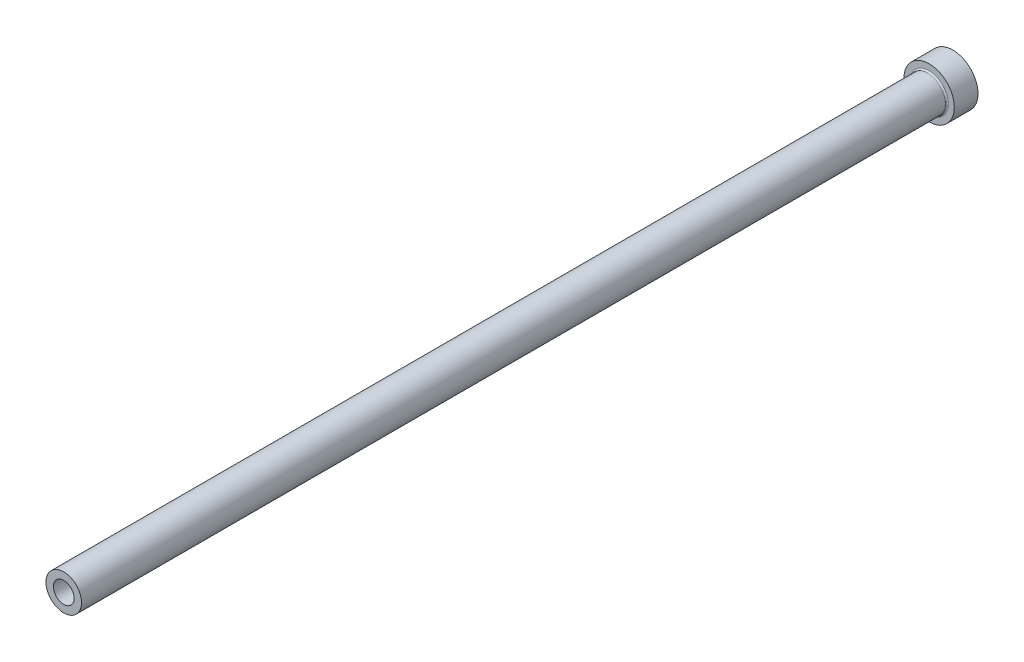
ISO-10303-21;
HEADER;
FILE_DESCRIPTION(('STEP AP214'),'2;1');
FILE_NAME('part.step','',(''),(''),'','','');
FILE_SCHEMA(('AUTOMOTIVE_DESIGN { 1 0 10303 214 1 1 1 1 }'));
ENDSEC;
DATA;
#1=APPLICATION_CONTEXT('core data for automotive mechanical design processes');
#2=APPLICATION_PROTOCOL_DEFINITION('international standard','automotive_design',2000,#1);
#3=PRODUCT_CONTEXT('',#1,'mechanical');
#4=PRODUCT('Part','Part','',(#3));
#5=PRODUCT_RELATED_PRODUCT_CATEGORY('part','',(#4));
#6=PRODUCT_DEFINITION_FORMATION('','',#4);
#7=PRODUCT_DEFINITION_CONTEXT('part definition',#1,'design');
#8=PRODUCT_DEFINITION('design','',#6,#7);
#9=PRODUCT_DEFINITION_SHAPE('','',#8);
#10=(LENGTH_UNIT() NAMED_UNIT(*) SI_UNIT(.MILLI.,.METRE.));
#11=(NAMED_UNIT(*) PLANE_ANGLE_UNIT() SI_UNIT($,.RADIAN.));
#12=(NAMED_UNIT(*) SI_UNIT($,.STERADIAN.) SOLID_ANGLE_UNIT());
#13=UNCERTAINTY_MEASURE_WITH_UNIT(LENGTH_MEASURE(1.E-05),#10,'distance_accuracy_value','');
#14=(GEOMETRIC_REPRESENTATION_CONTEXT(3) GLOBAL_UNCERTAINTY_ASSIGNED_CONTEXT((#13)) GLOBAL_UNIT_ASSIGNED_CONTEXT((#10,
#11,#12)) REPRESENTATION_CONTEXT('',''));
#15=CARTESIAN_POINT('',(0.,0.,0.));
#16=DIRECTION('',(0.,0.,1.));
#17=DIRECTION('',(1.,0.,0.));
#18=AXIS2_PLACEMENT_3D('',#15,#16,#17);
#19=CARTESIAN_POINT('',(0.,0.,300.));
#20=DIRECTION('',(0.,0.,-1.));
#21=DIRECTION('',(-1.,0.,0.));
#22=AXIS2_PLACEMENT_3D('',#19,#20,#21);
#23=PLANE('',#22);
#24=CARTESIAN_POINT('',(0.,0.,300.));
#25=DIRECTION('',(0.,0.,1.));
#26=DIRECTION('',(1.,0.,0.));
#27=AXIS2_PLACEMENT_3D('',#24,#25,#26);
#28=CIRCLE('',#27,3.49999999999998);
#29=CARTESIAN_POINT('',(3.49999999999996,0.,300.));
#30=VERTEX_POINT('',#29);
#31=EDGE_CURVE('E63',#30,#30,#28,.T.);
#32=ORIENTED_EDGE('',*,*,#31,.F.);
#33=EDGE_LOOP('',(#32));
#34=FACE_BOUND('',#33,.T.);
#35=CARTESIAN_POINT('',(0.,0.,300.));
#36=DIRECTION('',(0.,0.,1.));
#37=DIRECTION('',(1.,0.,0.));
#38=AXIS2_PLACEMENT_3D('',#35,#36,#37);
#39=CIRCLE('',#38,5.99999999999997);
#40=CARTESIAN_POINT('',(5.99999999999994,0.,300.));
#41=VERTEX_POINT('',#40);
#42=EDGE_CURVE('E54',#41,#41,#39,.T.);
#43=ORIENTED_EDGE('',*,*,#42,.T.);
#44=EDGE_LOOP('',(#43));
#45=FACE_BOUND('',#44,.T.);
#46=ADVANCED_FACE('F34',(#34,#45),#23,.F.);
#47=CARTESIAN_POINT('',(0.,0.,300.));
#48=DIRECTION('',(0.,0.,1.));
#49=DIRECTION('',(1.,0.,0.));
#50=AXIS2_PLACEMENT_3D('',#47,#48,#49);
#51=CYLINDRICAL_SURFACE('',#50,5.99999999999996);
#52=CARTESIAN_POINT('',(0.,0.,8.50000000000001));
#53=DIRECTION('',(0.,0.,1.));
#54=DIRECTION('',(1.,0.,0.));
#55=AXIS2_PLACEMENT_3D('',#52,#53,#54);
#56=CIRCLE('',#55,5.99999999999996);
#57=CARTESIAN_POINT('',(5.99999999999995,0.,8.50000000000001));
#58=VERTEX_POINT('',#57);
#59=EDGE_CURVE('E49',#58,#58,#56,.T.);
#60=ORIENTED_EDGE('',*,*,#59,.T.);
#61=EDGE_LOOP('',(#60));
#62=FACE_BOUND('',#61,.T.);
#63=ORIENTED_EDGE('',*,*,#42,.F.);
#64=EDGE_LOOP('',(#63));
#65=FACE_BOUND('',#64,.T.);
#66=ADVANCED_FACE('F92',(#62,#65),#51,.T.);
#67=CARTESIAN_POINT('',(0.,0.,8.));
#68=DIRECTION('',(0.,0.,1.));
#69=DIRECTION('',(1.,0.,0.));
#70=AXIS2_PLACEMENT_3D('',#67,#68,#69);
#71=PLANE('',#70);
#72=CARTESIAN_POINT('',(0.,0.,8.));
#73=DIRECTION('',(0.,0.,1.));
#74=DIRECTION('',(1.,0.,0.));
#75=AXIS2_PLACEMENT_3D('',#72,#73,#74);
#76=CIRCLE('',#75,6.49999999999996);
#77=CARTESIAN_POINT('',(6.49999999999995,0.,8.));
#78=VERTEX_POINT('',#77);
#79=EDGE_CURVE('E45',#78,#78,#76,.F.);
#80=ORIENTED_EDGE('',*,*,#79,.T.);
#81=EDGE_LOOP('',(#80));
#82=FACE_BOUND('',#81,.T.);
#83=CARTESIAN_POINT('',(0.,0.,8.00000000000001));
#84=DIRECTION('',(0.,0.,1.));
#85=DIRECTION('',(1.,0.,0.));
#86=AXIS2_PLACEMENT_3D('',#83,#84,#85);
#87=CIRCLE('',#86,8.49999999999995);
#88=CARTESIAN_POINT('',(8.49999999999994,0.,8.00000000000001));
#89=VERTEX_POINT('',#88);
#90=EDGE_CURVE('E57',#89,#89,#87,.T.);
#91=ORIENTED_EDGE('',*,*,#90,.T.);
#92=EDGE_LOOP('',(#91));
#93=FACE_BOUND('',#92,.T.);
#94=ADVANCED_FACE('F98',(#82,#93),#71,.T.);
#95=CARTESIAN_POINT('',(0.,0.,300.));
#96=DIRECTION('',(0.,0.,1.));
#97=DIRECTION('',(1.,0.,0.));
#98=AXIS2_PLACEMENT_3D('',#95,#96,#97);
#99=CYLINDRICAL_SURFACE('',#98,8.49999999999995);
#100=ORIENTED_EDGE('',*,*,#90,.F.);
#101=EDGE_LOOP('',(#100));
#102=FACE_BOUND('',#101,.T.);
#103=CARTESIAN_POINT('',(0.,0.,0.));
#104=DIRECTION('',(0.,0.,1.));
#105=DIRECTION('',(1.,0.,0.));
#106=AXIS2_PLACEMENT_3D('',#103,#104,#105);
#107=CIRCLE('',#106,8.49999999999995);
#108=CARTESIAN_POINT('',(8.49999999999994,0.,0.));
#109=VERTEX_POINT('',#108);
#110=EDGE_CURVE('E60',#109,#109,#107,.T.);
#111=ORIENTED_EDGE('',*,*,#110,.T.);
#112=EDGE_LOOP('',(#111));
#113=FACE_BOUND('',#112,.T.);
#114=ADVANCED_FACE('F89',(#102,#113),#99,.T.);
#115=CARTESIAN_POINT('',(0.,0.,0.));
#116=DIRECTION('',(0.,0.,1.));
#117=DIRECTION('',(1.,0.,0.));
#118=AXIS2_PLACEMENT_3D('',#115,#116,#117);
#119=PLANE('',#118);
#120=CARTESIAN_POINT('',(0.,0.,0.));
#121=DIRECTION('',(0.,0.,1.));
#122=DIRECTION('',(1.,0.,0.));
#123=AXIS2_PLACEMENT_3D('',#120,#121,#122);
#124=CIRCLE('',#123,4.24999999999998);
#125=CARTESIAN_POINT('',(4.24999999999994,0.,0.));
#126=VERTEX_POINT('',#125);
#127=EDGE_CURVE('E41',#126,#126,#124,.T.);
#128=ORIENTED_EDGE('',*,*,#127,.T.);
#129=EDGE_LOOP('',(#128));
#130=FACE_BOUND('',#129,.T.);
#131=ORIENTED_EDGE('',*,*,#110,.F.);
#132=EDGE_LOOP('',(#131));
#133=FACE_BOUND('',#132,.T.);
#134=ADVANCED_FACE('F83',(#130,#133),#119,.F.);
#135=CARTESIAN_POINT('',(0.,0.,300.));
#136=DIRECTION('',(0.,0.,1.));
#137=DIRECTION('',(1.,0.,0.));
#138=AXIS2_PLACEMENT_3D('',#135,#136,#137);
#139=CYLINDRICAL_SURFACE('',#138,3.5);
#140=ORIENTED_EDGE('',*,*,#31,.T.);
#141=EDGE_LOOP('',(#140));
#142=FACE_BOUND('',#141,.T.);
#143=CARTESIAN_POINT('',(0.,0.,185.));
#144=DIRECTION('',(0.,0.,1.));
#145=DIRECTION('',(1.,0.,0.));
#146=AXIS2_PLACEMENT_3D('',#143,#144,#145);
#147=CIRCLE('',#146,3.50000000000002);
#148=CARTESIAN_POINT('',(3.49999999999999,0.,185.));
#149=VERTEX_POINT('',#148);
#150=EDGE_CURVE('E66',#149,#149,#147,.T.);
#151=ORIENTED_EDGE('',*,*,#150,.F.);
#152=EDGE_LOOP('',(#151));
#153=FACE_BOUND('',#152,.T.);
#154=ADVANCED_FACE('F78',(#142,#153),#139,.F.);
#155=CARTESIAN_POINT('',(0.,0.,185.));
#156=DIRECTION('',(0.,0.,-1.));
#157=DIRECTION('',(-1.,0.,0.));
#158=AXIS2_PLACEMENT_3D('',#155,#156,#157);
#159=CONICAL_SURFACE('',#158,3.50000000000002,0.523598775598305);
#160=CARTESIAN_POINT('',(0.,0.,184.566987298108));
#161=DIRECTION('',(0.,0.,1.));
#162=DIRECTION('',(1.,0.,0.));
#163=AXIS2_PLACEMENT_3D('',#160,#161,#162);
#164=CIRCLE('',#163,3.74999999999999);
#165=CARTESIAN_POINT('',(3.74999999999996,0.,184.566987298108));
#166=VERTEX_POINT('',#165);
#167=EDGE_CURVE('E69',#166,#166,#164,.T.);
#168=ORIENTED_EDGE('',*,*,#167,.F.);
#169=EDGE_LOOP('',(#168));
#170=FACE_BOUND('',#169,.T.);
#171=ORIENTED_EDGE('',*,*,#150,.T.);
#172=EDGE_LOOP('',(#171));
#173=FACE_BOUND('',#172,.T.);
#174=ADVANCED_FACE('F75',(#170,#173),#159,.F.);
#175=CARTESIAN_POINT('',(0.,0.,300.));
#176=DIRECTION('',(0.,0.,1.));
#177=DIRECTION('',(1.,0.,0.));
#178=AXIS2_PLACEMENT_3D('',#175,#176,#177);
#179=CYLINDRICAL_SURFACE('',#178,3.74999999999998);
#180=CARTESIAN_POINT('',(0.,0.,0.5));
#181=DIRECTION('',(0.,0.,1.));
#182=DIRECTION('',(1.,0.,0.));
#183=AXIS2_PLACEMENT_3D('',#180,#181,#182);
#184=CIRCLE('',#183,3.74999999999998);
#185=CARTESIAN_POINT('',(3.74999999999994,0.,0.5));
#186=VERTEX_POINT('',#185);
#187=EDGE_CURVE('E10',#186,#186,#184,.F.);
#188=ORIENTED_EDGE('',*,*,#187,.T.);
#189=EDGE_LOOP('',(#188));
#190=FACE_BOUND('',#189,.T.);
#191=ORIENTED_EDGE('',*,*,#167,.T.);
#192=EDGE_LOOP('',(#191));
#193=FACE_BOUND('',#192,.T.);
#194=ADVANCED_FACE('F73',(#190,#193),#179,.F.);
#195=CARTESIAN_POINT('',(0.,0.,8.50000000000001));
#196=DIRECTION('',(0.,0.,1.));
#197=DIRECTION('',(1.,0.,0.));
#198=AXIS2_PLACEMENT_3D('',#195,#196,#197);
#199=TOROIDAL_SURFACE('',#198,6.49999999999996,0.5);
#200=ORIENTED_EDGE('',*,*,#79,.F.);
#201=EDGE_LOOP('',(#200));
#202=FACE_BOUND('',#201,.T.);
#203=ORIENTED_EDGE('',*,*,#59,.F.);
#204=EDGE_LOOP('',(#203));
#205=FACE_BOUND('',#204,.T.);
#206=ADVANCED_FACE('F104',(#202,#205),#199,.F.);
#207=CARTESIAN_POINT('',(0.,0.,0.));
#208=DIRECTION('',(0.,0.,-1.));
#209=DIRECTION('',(-1.,0.,0.));
#210=AXIS2_PLACEMENT_3D('',#207,#208,#209);
#211=CONICAL_SURFACE('',#210,4.24999999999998,0.785398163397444);
#212=ORIENTED_EDGE('',*,*,#187,.F.);
#213=EDGE_LOOP('',(#212));
#214=FACE_BOUND('',#213,.T.);
#215=ORIENTED_EDGE('',*,*,#127,.F.);
#216=EDGE_LOOP('',(#215));
#217=FACE_BOUND('',#216,.T.);
#218=ADVANCED_FACE('F36',(#214,#217),#211,.F.);
#219=CLOSED_SHELL('',(#46,#66,#94,#114,#134,#154,#174,#194,#206,#218));
#220=MANIFOLD_SOLID_BREP('B2',#219);
#221=ADVANCED_BREP_SHAPE_REPRESENTATION('',(#18,#220),#14);
#222=SHAPE_DEFINITION_REPRESENTATION(#9,#221);
ENDSEC;
END-ISO-10303-21;
